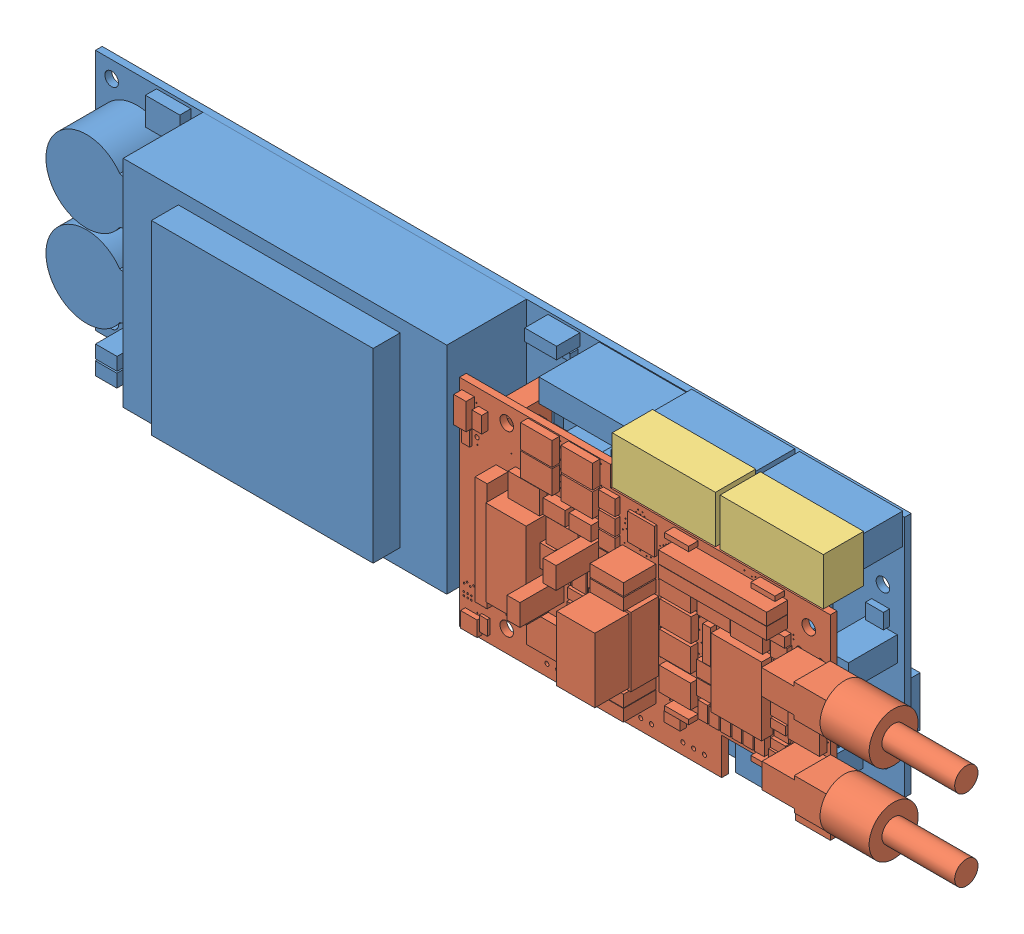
SolidWorks assembly DFlogger.SLDASM, configuration Default (file format 7000). Lengths in mm.
Overall size (226.79 58.69 44.02).
4 component instances, 3 part files, 10 mates.
Components (placement in the parent):
- 10020446rA-1: 10020446rA.SLDPRT [Default] at origin size (190.5 58.23 37.15)
- 1002055rA_1-2: 1002055rA_1.SLDPRT [Default] at (103.1875 0 17.4625) size (123.6 50.8 31.76)
- Phoenix_1843240-1: Phoenix_1843240.SLDPRT [Default] at (165.7758 58.6854 20.2874) x (1 0 0) z (0 1 0) size (24.3 9.5 11.1)
- Phoenix_1843240-2: Phoenix_1843240.SLDPRT [Default] at (140.3758 58.6854 20.2874) x (1 0 0) z (0 1 0) size (24.3 9.5 11.1)
Mates (geometry in assembly coordinates):
- Parallel2: parallel anti-aligned: plane of 10020446rA-1 through (0 0 1.5875) normal (0 0 1); plane of 1002055rA_1-2 through (103.1875 0 17.4625) normal (0 0 -1)
- Distance3: distance = 15.875 mm anti-aligned: plane of 1002055rA_1-2 through (103.1875 0 17.4625) normal (0 0 -1); plane of 10020446rA-1 through (0 0 1.5875) normal (0 0 1)
- Coincident14: coincident aligned: plane of 10020446rA-1 through (190.5 0 1.5875) normal (1 0 0); plane of 1002055rA_1-2 through (190.5 0 19.05) normal (1 0 0)
- Coincident15: coincident aligned: plane of 10020446rA-1 through (0 0 1.5875) normal (0 -1 0); plane of 1002055rA_1-2 through (103.1875 0 19.05) normal (0 -1 0)
- Coincident16: coincident anti-aligned: plane of Phoenix_1843240-1 through (165.7758 47.5854 10.7874) normal (0 0 -1); plane of ? through (190.0758 50.9854 10.7874) normal (0 0 1)
- Coincident17: coincident aligned: plane of ? through (190.0758 58.2346 10.7874) normal (1 0 0); plane of Phoenix_1843240-1 through (190.0758 58.6854 10.7874) normal (1 0 0)
- Distance4: distance = 3.4 mm aligned: plane of ? through (190.0758 50.9854 10.7874) normal (0 -1 0); plane of Phoenix_1843240-1 through (165.7758 47.5854 10.7874) normal (0 -1 0)
- Coincident19: coincident anti-aligned: plane of ? through (164.6758 50.9854 10.7874) normal (0 0 1); plane of Phoenix_1843240-2 through (140.3758 47.5854 10.7874) normal (0 0 -1)
- Coincident20: coincident aligned: plane of ? through (164.6758 58.2346 10.7874) normal (1 0 0); plane of Phoenix_1843240-2 through (164.6758 58.6854 10.7874) normal (1 0 0)
- Distance5: distance = 3.4 mm aligned: plane of Phoenix_1843240-2 through (140.3758 47.5854 10.7874) normal (0 -1 0); plane of ? through (164.6758 50.9854 10.7874) normal (0 -1 0)
